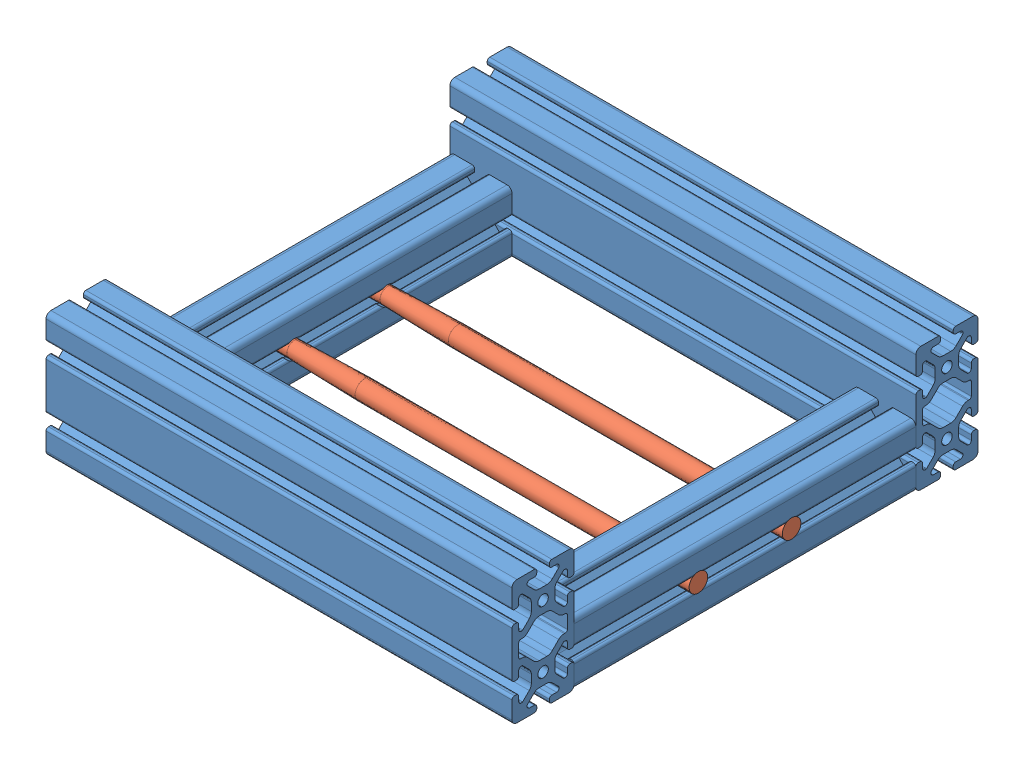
SolidWorks assembly Assem1.sldasm, configuration Default (file format 9000). Lengths in mm.
Overall size (300 80 300).
3 component instances, 2 part files, 7 mates.
Components (placement in the parent):
- structure-1: structure.SLDPRT [Default<As Machined>] at (-150 0 110) x (-1 0 0) z (0 0 1) size (300 80 300)
- heater-1: heater.SLDPRT [Default] at (-300 20 80) size (300 12 12)
- heater-2: heater.SLDPRT [Default] at (-300 20 140) x (1 0 0) z (0 -0.093808 0.99559) size (300 12 12)
Mates (geometry in assembly coordinates):
- Coincident2: coincident anti-aligned: plane of structure-1 through (-25.63 0 -40) normal (0 -1 0); plane of assembly through (0 0 0) normal (0 1 0)
- Coincident3: coincident aligned: plane of structure-1 through (-300 25.63 0) normal (0 0 1); plane of assembly through (0 0 0) normal (0 0 1)
- Coincident4: coincident aligned: plane of structure-1 through (0 14.37 -40) normal (1 0 0); plane of assembly through (0 0 0) normal (1 0 0)
- Concentric1: concentric aligned: cylinder of structure-1 through (0 20 80) axis (-1 0 0) radius 6; cylinder of heater-1 through (-300 20 80) axis (-1 0 0) radius 6
- Coincident5: coincident aligned: plane of structure-1 through (0 36.83 -40) normal (1 0 0); plane of heater-1 through (0 20 80) normal (1 0 0)
- Concentric2: concentric aligned: cylinder of heater-2 through (-300 20 140) axis (-1 0 0) radius 6; cylinder of structure-1 through (0 20 140) axis (-1 0 0) radius 6
- Coincident6: coincident aligned: plane of structure-1 through (-300 25.63 -40) normal (-1 0 0); plane of heater-2 through (-300 24.978 140.469) normal (-1 0 0)
